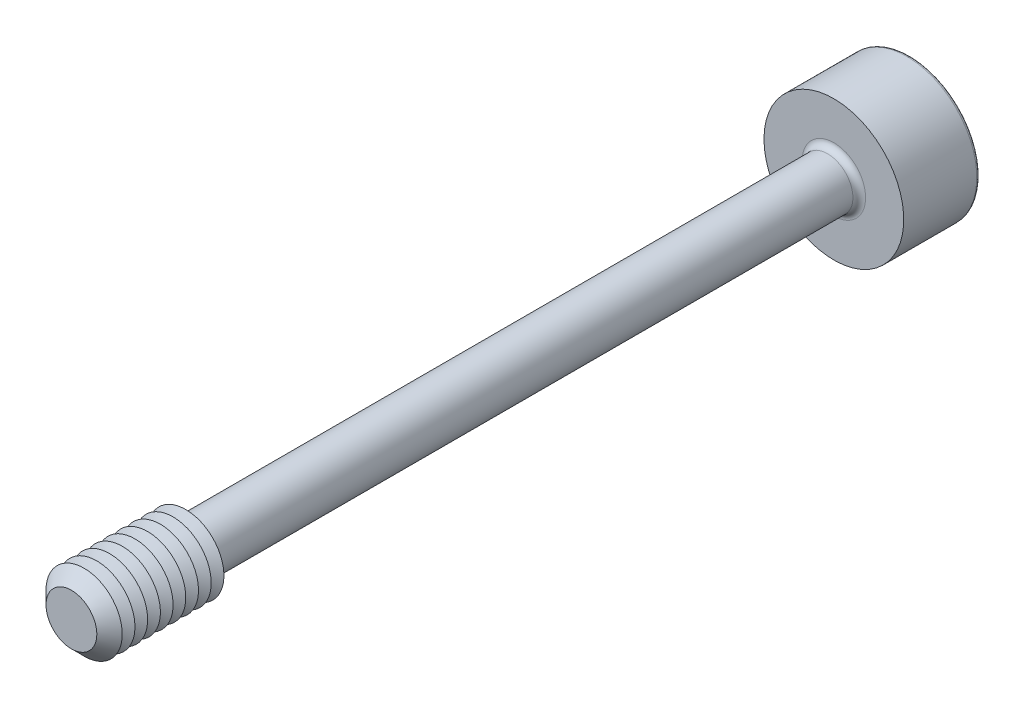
ISO-10303-21;
HEADER;
FILE_DESCRIPTION(('STEP AP214'),'2;1');
FILE_NAME('part.step','',(''),(''),'','','');
FILE_SCHEMA(('AUTOMOTIVE_DESIGN { 1 0 10303 214 1 1 1 1 }'));
ENDSEC;
DATA;
#1=APPLICATION_CONTEXT('core data for automotive mechanical design processes');
#2=APPLICATION_PROTOCOL_DEFINITION('international standard','automotive_design',2000,#1);
#3=PRODUCT_CONTEXT('',#1,'mechanical');
#4=PRODUCT('Part','Part','',(#3));
#5=PRODUCT_RELATED_PRODUCT_CATEGORY('part','',(#4));
#6=PRODUCT_DEFINITION_FORMATION('','',#4);
#7=PRODUCT_DEFINITION_CONTEXT('part definition',#1,'design');
#8=PRODUCT_DEFINITION('design','',#6,#7);
#9=PRODUCT_DEFINITION_SHAPE('','',#8);
#10=(LENGTH_UNIT() NAMED_UNIT(*) SI_UNIT(.MILLI.,.METRE.));
#11=(NAMED_UNIT(*) PLANE_ANGLE_UNIT() SI_UNIT($,.RADIAN.));
#12=(NAMED_UNIT(*) SI_UNIT($,.STERADIAN.) SOLID_ANGLE_UNIT());
#13=UNCERTAINTY_MEASURE_WITH_UNIT(LENGTH_MEASURE(1.E-05),#10,'distance_accuracy_value','');
#14=(GEOMETRIC_REPRESENTATION_CONTEXT(3) GLOBAL_UNCERTAINTY_ASSIGNED_CONTEXT((#13)) GLOBAL_UNIT_ASSIGNED_CONTEXT((#10,
#11,#12)) REPRESENTATION_CONTEXT('',''));
#15=CARTESIAN_POINT('',(0.,0.,0.));
#16=DIRECTION('',(0.,0.,1.));
#17=DIRECTION('',(1.,0.,0.));
#18=AXIS2_PLACEMENT_3D('',#15,#16,#17);
#19=CARTESIAN_POINT('',(-0.721687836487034,-1.25,-15.5));
#20=DIRECTION('',(0.,0.,1.));
#21=DIRECTION('',(1.,0.,0.));
#22=AXIS2_PLACEMENT_3D('',#19,#20,#21);
#23=PLANE('',#22);
#24=DIRECTION('',(1.,0.,0.));
#25=VECTOR('',#24,1.);
#26=CARTESIAN_POINT('',(-0.721687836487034,-1.25,-15.5));
#27=LINE('',#26,#25);
#28=CARTESIAN_POINT('',(0.,-1.25,-15.5));
#29=VERTEX_POINT('',#28);
#30=CARTESIAN_POINT('',(0.721687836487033,-1.25,-15.5));
#31=VERTEX_POINT('',#30);
#32=EDGE_CURVE('E412',#29,#31,#27,.T.);
#33=ORIENTED_EDGE('',*,*,#32,.F.);
#34=CARTESIAN_POINT('',(0.,0.,-15.5));
#35=DIRECTION('',(0.,0.,1.));
#36=DIRECTION('',(0.,-1.,0.));
#37=AXIS2_PLACEMENT_3D('',#34,#35,#36);
#38=CIRCLE('',#37,1.25);
#39=CARTESIAN_POINT('',(1.08253175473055,-0.624999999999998,-15.5));
#40=VERTEX_POINT('',#39);
#41=EDGE_CURVE('E53',#29,#40,#38,.T.);
#42=ORIENTED_EDGE('',*,*,#41,.T.);
#43=DIRECTION('',(0.499999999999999,0.866025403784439,0.));
#44=VECTOR('',#43,1.);
#45=CARTESIAN_POINT('',(0.721687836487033,-1.25,-15.5));
#46=LINE('',#45,#44);
#47=EDGE_CURVE('E401',#31,#40,#46,.T.);
#48=ORIENTED_EDGE('',*,*,#47,.F.);
#49=EDGE_LOOP('',(#33,#42,#48));
#50=FACE_BOUND('',#49,.T.);
#51=ADVANCED_FACE('F41',(#50),#23,.F.);
#52=CARTESIAN_POINT('',(1.44337567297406,0.,-15.5));
#53=VERTEX_POINT('',#52);
#54=EDGE_CURVE('E406',#40,#53,#46,.T.);
#55=ORIENTED_EDGE('',*,*,#54,.F.);
#56=CARTESIAN_POINT('',(1.08253175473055,0.625000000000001,-15.5));
#57=VERTEX_POINT('',#56);
#58=EDGE_CURVE('E11',#40,#57,#38,.T.);
#59=ORIENTED_EDGE('',*,*,#58,.T.);
#60=DIRECTION('',(-0.499999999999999,0.866025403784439,0.));
#61=VECTOR('',#60,1.);
#62=CARTESIAN_POINT('',(1.44337567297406,0.,-15.5));
#63=LINE('',#62,#61);
#64=EDGE_CURVE('E397',#53,#57,#63,.T.);
#65=ORIENTED_EDGE('',*,*,#64,.F.);
#66=EDGE_LOOP('',(#55,#59,#65));
#67=FACE_BOUND('',#66,.T.);
#68=ADVANCED_FACE('F133',(#67),#23,.F.);
#69=CARTESIAN_POINT('',(0.721687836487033,1.25,-15.5));
#70=VERTEX_POINT('',#69);
#71=EDGE_CURVE('E396',#57,#70,#63,.T.);
#72=ORIENTED_EDGE('',*,*,#71,.F.);
#73=CARTESIAN_POINT('',(0.,1.25,-15.5));
#74=VERTEX_POINT('',#73);
#75=EDGE_CURVE('E51',#57,#74,#38,.T.);
#76=ORIENTED_EDGE('',*,*,#75,.T.);
#77=DIRECTION('',(-1.,0.,0.));
#78=VECTOR('',#77,1.);
#79=CARTESIAN_POINT('',(0.721687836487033,1.25,-15.5));
#80=LINE('',#79,#78);
#81=EDGE_CURVE('E177',#70,#74,#80,.T.);
#82=ORIENTED_EDGE('',*,*,#81,.F.);
#83=EDGE_LOOP('',(#72,#76,#82));
#84=FACE_BOUND('',#83,.T.);
#85=ADVANCED_FACE('F139',(#84),#23,.F.);
#86=CARTESIAN_POINT('',(-0.721687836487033,1.25,-15.5));
#87=VERTEX_POINT('',#86);
#88=EDGE_CURVE('E403',#74,#87,#80,.T.);
#89=ORIENTED_EDGE('',*,*,#88,.F.);
#90=CARTESIAN_POINT('',(-1.08253175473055,0.625000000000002,-15.5));
#91=VERTEX_POINT('',#90);
#92=EDGE_CURVE('E266',#74,#91,#38,.T.);
#93=ORIENTED_EDGE('',*,*,#92,.T.);
#94=DIRECTION('',(-0.5,-0.866025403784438,0.));
#95=VECTOR('',#94,1.);
#96=CARTESIAN_POINT('',(-0.721687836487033,1.25,-15.5));
#97=LINE('',#96,#95);
#98=EDGE_CURVE('E176',#87,#91,#97,.T.);
#99=ORIENTED_EDGE('',*,*,#98,.F.);
#100=EDGE_LOOP('',(#89,#93,#99));
#101=FACE_BOUND('',#100,.T.);
#102=ADVANCED_FACE('F157',(#101),#23,.F.);
#103=CARTESIAN_POINT('',(-1.44337567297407,0.,-15.5));
#104=VERTEX_POINT('',#103);
#105=EDGE_CURVE('E170',#91,#104,#97,.T.);
#106=ORIENTED_EDGE('',*,*,#105,.F.);
#107=CARTESIAN_POINT('',(-1.08253175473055,-0.624999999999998,-15.5));
#108=VERTEX_POINT('',#107);
#109=EDGE_CURVE('E172',#91,#108,#38,.T.);
#110=ORIENTED_EDGE('',*,*,#109,.T.);
#111=DIRECTION('',(0.5,-0.866025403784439,0.));
#112=VECTOR('',#111,1.);
#113=CARTESIAN_POINT('',(-1.44337567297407,0.,-15.5));
#114=LINE('',#113,#112);
#115=EDGE_CURVE('E174',#104,#108,#114,.T.);
#116=ORIENTED_EDGE('',*,*,#115,.F.);
#117=EDGE_LOOP('',(#106,#110,#116));
#118=FACE_BOUND('',#117,.T.);
#119=ADVANCED_FACE('F146',(#118),#23,.F.);
#120=CARTESIAN_POINT('',(0.,0.,-18.));
#121=DIRECTION('',(0.,0.,-1.));
#122=DIRECTION('',(-1.,0.,0.));
#123=AXIS2_PLACEMENT_3D('',#120,#121,#122);
#124=PLANE('',#123);
#125=CARTESIAN_POINT('',(0.,0.,-18.));
#126=DIRECTION('',(0.,0.,-1.));
#127=DIRECTION('',(-1.,0.,0.));
#128=AXIS2_PLACEMENT_3D('',#125,#126,#127);
#129=CIRCLE('',#128,2.625);
#130=CARTESIAN_POINT('',(-2.625,0.,-18.));
#131=VERTEX_POINT('',#130);
#132=EDGE_CURVE('E250',#131,#131,#129,.T.);
#133=ORIENTED_EDGE('',*,*,#132,.T.);
#134=EDGE_LOOP('',(#133));
#135=FACE_BOUND('',#134,.T.);
#136=DIRECTION('',(-0.5,-0.866025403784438,0.));
#137=VECTOR('',#136,1.);
#138=CARTESIAN_POINT('',(-0.721687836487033,1.25,-18.));
#139=LINE('',#138,#137);
#140=CARTESIAN_POINT('',(-0.721687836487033,1.25,-18.));
#141=VERTEX_POINT('',#140);
#142=CARTESIAN_POINT('',(-1.44337567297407,0.,-18.));
#143=VERTEX_POINT('',#142);
#144=EDGE_CURVE('E212',#141,#143,#139,.T.);
#145=ORIENTED_EDGE('',*,*,#144,.T.);
#146=DIRECTION('',(0.5,-0.866025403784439,0.));
#147=VECTOR('',#146,1.);
#148=CARTESIAN_POINT('',(-1.44337567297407,0.,-18.));
#149=LINE('',#148,#147);
#150=CARTESIAN_POINT('',(-0.721687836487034,-1.25,-18.));
#151=VERTEX_POINT('',#150);
#152=EDGE_CURVE('E67',#143,#151,#149,.T.);
#153=ORIENTED_EDGE('',*,*,#152,.T.);
#154=DIRECTION('',(1.,0.,0.));
#155=VECTOR('',#154,1.);
#156=CARTESIAN_POINT('',(-0.721687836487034,-1.25,-18.));
#157=LINE('',#156,#155);
#158=CARTESIAN_POINT('',(0.721687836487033,-1.25,-18.));
#159=VERTEX_POINT('',#158);
#160=EDGE_CURVE('E196',#151,#159,#157,.T.);
#161=ORIENTED_EDGE('',*,*,#160,.T.);
#162=DIRECTION('',(0.499999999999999,0.866025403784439,0.));
#163=VECTOR('',#162,1.);
#164=CARTESIAN_POINT('',(0.721687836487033,-1.25,-18.));
#165=LINE('',#164,#163);
#166=CARTESIAN_POINT('',(1.44337567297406,0.,-18.));
#167=VERTEX_POINT('',#166);
#168=EDGE_CURVE('E200',#159,#167,#165,.T.);
#169=ORIENTED_EDGE('',*,*,#168,.T.);
#170=DIRECTION('',(-0.499999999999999,0.866025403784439,0.));
#171=VECTOR('',#170,1.);
#172=CARTESIAN_POINT('',(1.44337567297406,0.,-18.));
#173=LINE('',#172,#171);
#174=CARTESIAN_POINT('',(0.721687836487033,1.25,-18.));
#175=VERTEX_POINT('',#174);
#176=EDGE_CURVE('E204',#167,#175,#173,.T.);
#177=ORIENTED_EDGE('',*,*,#176,.T.);
#178=DIRECTION('',(-1.,0.,0.));
#179=VECTOR('',#178,1.);
#180=CARTESIAN_POINT('',(0.721687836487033,1.25,-18.));
#181=LINE('',#180,#179);
#182=EDGE_CURVE('E208',#175,#141,#181,.T.);
#183=ORIENTED_EDGE('',*,*,#182,.T.);
#184=EDGE_LOOP('',(#145,#153,#161,#169,#177,#183));
#185=FACE_BOUND('',#184,.T.);
#186=ADVANCED_FACE('F156',(#135,#185),#124,.T.);
#187=CARTESIAN_POINT('',(0.,0.,15.));
#188=DIRECTION('',(0.,0.,-1.));
#189=DIRECTION('',(-1.,0.,0.));
#190=AXIS2_PLACEMENT_3D('',#187,#188,#189);
#191=CYLINDRICAL_SURFACE('',#190,1.);
#192=CARTESIAN_POINT('',(0.,0.,-14.75));
#193=DIRECTION('',(0.,0.,-1.));
#194=DIRECTION('',(-1.,0.,0.));
#195=AXIS2_PLACEMENT_3D('',#192,#193,#194);
#196=CIRCLE('',#195,1.);
#197=CARTESIAN_POINT('',(-1.,0.,-14.75));
#198=VERTEX_POINT('',#197);
#199=EDGE_CURVE('E247',#198,#198,#196,.F.);
#200=ORIENTED_EDGE('',*,*,#199,.T.);
#201=EDGE_LOOP('',(#200));
#202=FACE_BOUND('',#201,.T.);
#203=CARTESIAN_POINT('',(0.,0.,10.2113248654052));
#204=DIRECTION('',(0.,0.,-1.));
#205=DIRECTION('',(0.,1.,0.));
#206=AXIS2_PLACEMENT_3D('',#203,#204,#205);
#207=CIRCLE('',#206,1.);
#208=CARTESIAN_POINT('',(0.,1.,10.2113248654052));
#209=VERTEX_POINT('',#208);
#210=EDGE_CURVE('E235',#209,#209,#207,.T.);
#211=ORIENTED_EDGE('',*,*,#210,.T.);
#212=EDGE_LOOP('',(#211));
#213=FACE_BOUND('',#212,.T.);
#214=ADVANCED_FACE('F163',(#202,#213),#191,.T.);
#215=CARTESIAN_POINT('',(0.,0.,10.2113248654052));
#216=DIRECTION('',(0.,0.,1.));
#217=DIRECTION('',(0.,-1.,0.));
#218=AXIS2_PLACEMENT_3D('',#215,#216,#217);
#219=CONICAL_SURFACE('',#218,1.,1.0471975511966);
#220=CARTESIAN_POINT('',(0.,0.,10.5));
#221=DIRECTION('',(0.,0.,-1.));
#222=DIRECTION('',(-1.,0.,0.));
#223=AXIS2_PLACEMENT_3D('',#220,#221,#222);
#224=CIRCLE('',#223,1.5);
#225=CARTESIAN_POINT('',(-1.5,0.,10.5));
#226=VERTEX_POINT('',#225);
#227=EDGE_CURVE('E270',#226,#226,#224,.T.);
#228=ORIENTED_EDGE('',*,*,#227,.T.);
#229=EDGE_LOOP('',(#228));
#230=FACE_BOUND('',#229,.T.);
#231=ORIENTED_EDGE('',*,*,#210,.F.);
#232=EDGE_LOOP('',(#231));
#233=FACE_BOUND('',#232,.T.);
#234=ADVANCED_FACE('F354',(#230,#233),#219,.T.);
#235=CARTESIAN_POINT('',(0.,0.,-15.));
#236=DIRECTION('',(0.,0.,-1.));
#237=DIRECTION('',(-1.,0.,0.));
#238=AXIS2_PLACEMENT_3D('',#235,#236,#237);
#239=PLANE('',#238);
#240=CARTESIAN_POINT('',(0.,0.,-15.));
#241=DIRECTION('',(0.,0.,-1.));
#242=DIRECTION('',(-1.,0.,0.));
#243=AXIS2_PLACEMENT_3D('',#240,#241,#242);
#244=CIRCLE('',#243,1.25);
#245=CARTESIAN_POINT('',(-1.25,0.,-15.));
#246=VERTEX_POINT('',#245);
#247=EDGE_CURVE('E243',#246,#246,#244,.T.);
#248=ORIENTED_EDGE('',*,*,#247,.T.);
#249=EDGE_LOOP('',(#248));
#250=FACE_BOUND('',#249,.T.);
#251=CARTESIAN_POINT('',(0.,0.,-15.));
#252=DIRECTION('',(0.,0.,-1.));
#253=DIRECTION('',(-1.,0.,0.));
#254=AXIS2_PLACEMENT_3D('',#251,#252,#253);
#255=CIRCLE('',#254,2.75);
#256=CARTESIAN_POINT('',(-2.75,0.,-15.));
#257=VERTEX_POINT('',#256);
#258=EDGE_CURVE('E231',#257,#257,#255,.T.);
#259=ORIENTED_EDGE('',*,*,#258,.F.);
#260=EDGE_LOOP('',(#259));
#261=FACE_BOUND('',#260,.T.);
#262=ADVANCED_FACE('F359',(#250,#261),#239,.F.);
#263=CARTESIAN_POINT('',(0.,0.,-18.));
#264=DIRECTION('',(0.,0.,1.));
#265=DIRECTION('',(1.,0.,0.));
#266=AXIS2_PLACEMENT_3D('',#263,#264,#265);
#267=CYLINDRICAL_SURFACE('',#266,2.75);
#268=CARTESIAN_POINT('',(0.,0.,-17.875));
#269=DIRECTION('',(0.,0.,-1.));
#270=DIRECTION('',(-1.,0.,0.));
#271=AXIS2_PLACEMENT_3D('',#268,#269,#270);
#272=CIRCLE('',#271,2.75);
#273=CARTESIAN_POINT('',(-2.75,0.,-17.875));
#274=VERTEX_POINT('',#273);
#275=EDGE_CURVE('E45',#274,#274,#272,.F.);
#276=ORIENTED_EDGE('',*,*,#275,.T.);
#277=EDGE_LOOP('',(#276));
#278=FACE_BOUND('',#277,.T.);
#279=ORIENTED_EDGE('',*,*,#258,.T.);
#280=EDGE_LOOP('',(#279));
#281=FACE_BOUND('',#280,.T.);
#282=ADVANCED_FACE('F360',(#278,#281),#267,.T.);
#283=CARTESIAN_POINT('',(-1.44337567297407,0.,-15.5));
#284=DIRECTION('',(0.866025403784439,0.5,0.));
#285=DIRECTION('',(-0.5,0.866025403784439,0.));
#286=AXIS2_PLACEMENT_3D('',#283,#284,#285);
#287=PLANE('',#286);
#288=ORIENTED_EDGE('',*,*,#152,.F.);
#289=DIRECTION('',(0.,0.,-1.));
#290=VECTOR('',#289,1.);
#291=CARTESIAN_POINT('',(-1.44337567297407,0.,-15.5));
#292=LINE('',#291,#290);
#293=EDGE_CURVE('E186',#104,#143,#292,.T.);
#294=ORIENTED_EDGE('',*,*,#293,.F.);
#295=ORIENTED_EDGE('',*,*,#115,.T.);
#296=CARTESIAN_POINT('',(-0.721687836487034,-1.25,-15.5));
#297=VERTEX_POINT('',#296);
#298=EDGE_CURVE('E215',#108,#297,#114,.T.);
#299=ORIENTED_EDGE('',*,*,#298,.T.);
#300=DIRECTION('',(0.,0.,-1.));
#301=VECTOR('',#300,1.);
#302=CARTESIAN_POINT('',(-0.721687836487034,-1.25,-15.5));
#303=LINE('',#302,#301);
#304=EDGE_CURVE('E228',#297,#151,#303,.T.);
#305=ORIENTED_EDGE('',*,*,#304,.T.);
#306=EDGE_LOOP('',(#288,#294,#295,#299,#305));
#307=FACE_BOUND('',#306,.T.);
#308=ADVANCED_FACE('F363',(#307),#287,.T.);
#309=CARTESIAN_POINT('',(-0.721687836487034,-1.25,-15.5));
#310=DIRECTION('',(0.,1.,0.));
#311=DIRECTION('',(0.,0.,1.));
#312=AXIS2_PLACEMENT_3D('',#309,#310,#311);
#313=PLANE('',#312);
#314=ORIENTED_EDGE('',*,*,#160,.F.);
#315=ORIENTED_EDGE('',*,*,#304,.F.);
#316=EDGE_CURVE('E409',#297,#29,#27,.T.);
#317=ORIENTED_EDGE('',*,*,#316,.T.);
#318=ORIENTED_EDGE('',*,*,#32,.T.);
#319=DIRECTION('',(0.,0.,-1.));
#320=VECTOR('',#319,1.);
#321=CARTESIAN_POINT('',(0.721687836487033,-1.25,-15.5));
#322=LINE('',#321,#320);
#323=EDGE_CURVE('E225',#31,#159,#322,.T.);
#324=ORIENTED_EDGE('',*,*,#323,.T.);
#325=EDGE_LOOP('',(#314,#315,#317,#318,#324));
#326=FACE_BOUND('',#325,.T.);
#327=ADVANCED_FACE('F369',(#326),#313,.T.);
#328=CARTESIAN_POINT('',(0.721687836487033,-1.25,-15.5));
#329=DIRECTION('',(-0.866025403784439,0.499999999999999,0.));
#330=DIRECTION('',(-0.499999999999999,-0.866025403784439,0.));
#331=AXIS2_PLACEMENT_3D('',#328,#329,#330);
#332=PLANE('',#331);
#333=ORIENTED_EDGE('',*,*,#168,.F.);
#334=ORIENTED_EDGE('',*,*,#323,.F.);
#335=ORIENTED_EDGE('',*,*,#47,.T.);
#336=ORIENTED_EDGE('',*,*,#54,.T.);
#337=DIRECTION('',(0.,0.,-1.));
#338=VECTOR('',#337,1.);
#339=CARTESIAN_POINT('',(1.44337567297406,0.,-15.5));
#340=LINE('',#339,#338);
#341=EDGE_CURVE('E222',#53,#167,#340,.T.);
#342=ORIENTED_EDGE('',*,*,#341,.T.);
#343=EDGE_LOOP('',(#333,#334,#335,#336,#342));
#344=FACE_BOUND('',#343,.T.);
#345=ADVANCED_FACE('F372',(#344),#332,.T.);
#346=CARTESIAN_POINT('',(1.44337567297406,0.,-15.5));
#347=DIRECTION('',(-0.866025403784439,-0.5,0.));
#348=DIRECTION('',(0.5,-0.866025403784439,0.));
#349=AXIS2_PLACEMENT_3D('',#346,#347,#348);
#350=PLANE('',#349);
#351=ORIENTED_EDGE('',*,*,#176,.F.);
#352=ORIENTED_EDGE('',*,*,#341,.F.);
#353=ORIENTED_EDGE('',*,*,#64,.T.);
#354=ORIENTED_EDGE('',*,*,#71,.T.);
#355=DIRECTION('',(0.,0.,-1.));
#356=VECTOR('',#355,1.);
#357=CARTESIAN_POINT('',(0.721687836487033,1.25,-15.5));
#358=LINE('',#357,#356);
#359=EDGE_CURVE('E219',#70,#175,#358,.T.);
#360=ORIENTED_EDGE('',*,*,#359,.T.);
#361=EDGE_LOOP('',(#351,#352,#353,#354,#360));
#362=FACE_BOUND('',#361,.T.);
#363=ADVANCED_FACE('F376',(#362),#350,.T.);
#364=CARTESIAN_POINT('',(0.721687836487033,1.25,-15.5));
#365=DIRECTION('',(0.,-1.,0.));
#366=DIRECTION('',(1.,0.,0.));
#367=AXIS2_PLACEMENT_3D('',#364,#365,#366);
#368=PLANE('',#367);
#369=ORIENTED_EDGE('',*,*,#182,.F.);
#370=ORIENTED_EDGE('',*,*,#359,.F.);
#371=ORIENTED_EDGE('',*,*,#81,.T.);
#372=ORIENTED_EDGE('',*,*,#88,.T.);
#373=DIRECTION('',(0.,0.,-1.));
#374=VECTOR('',#373,1.);
#375=CARTESIAN_POINT('',(-0.721687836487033,1.25,-15.5));
#376=LINE('',#375,#374);
#377=EDGE_CURVE('E182',#87,#141,#376,.T.);
#378=ORIENTED_EDGE('',*,*,#377,.T.);
#379=EDGE_LOOP('',(#369,#370,#371,#372,#378));
#380=FACE_BOUND('',#379,.T.);
#381=ADVANCED_FACE('F152',(#380),#368,.T.);
#382=CARTESIAN_POINT('',(-0.721687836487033,1.25,-15.5));
#383=DIRECTION('',(0.866025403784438,-0.5,0.));
#384=DIRECTION('',(0.5,0.866025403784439,0.));
#385=AXIS2_PLACEMENT_3D('',#382,#383,#384);
#386=PLANE('',#385);
#387=ORIENTED_EDGE('',*,*,#144,.F.);
#388=ORIENTED_EDGE('',*,*,#377,.F.);
#389=ORIENTED_EDGE('',*,*,#98,.T.);
#390=ORIENTED_EDGE('',*,*,#105,.T.);
#391=ORIENTED_EDGE('',*,*,#293,.T.);
#392=EDGE_LOOP('',(#387,#388,#389,#390,#391));
#393=FACE_BOUND('',#392,.T.);
#394=ADVANCED_FACE('F144',(#393),#386,.T.);
#395=ORIENTED_EDGE('',*,*,#298,.F.);
#396=EDGE_CURVE('E257',#108,#29,#38,.T.);
#397=ORIENTED_EDGE('',*,*,#396,.T.);
#398=ORIENTED_EDGE('',*,*,#316,.F.);
#399=EDGE_LOOP('',(#395,#397,#398));
#400=FACE_BOUND('',#399,.T.);
#401=ADVANCED_FACE('F135',(#400),#23,.F.);
#402=CARTESIAN_POINT('',(0.,0.,-14.75));
#403=DIRECTION('',(0.,0.,-1.));
#404=DIRECTION('',(-1.,0.,0.));
#405=AXIS2_PLACEMENT_3D('',#402,#403,#404);
#406=TOROIDAL_SURFACE('',#405,1.25,0.25);
#407=ORIENTED_EDGE('',*,*,#199,.F.);
#408=EDGE_LOOP('',(#407));
#409=FACE_BOUND('',#408,.T.);
#410=ORIENTED_EDGE('',*,*,#247,.F.);
#411=EDGE_LOOP('',(#410));
#412=FACE_BOUND('',#411,.T.);
#413=ADVANCED_FACE('F129',(#409,#412),#406,.F.);
#414=CARTESIAN_POINT('',(0.,0.,-17.875));
#415=DIRECTION('',(0.,0.,-1.));
#416=DIRECTION('',(-1.,0.,0.));
#417=AXIS2_PLACEMENT_3D('',#414,#415,#416);
#418=TOROIDAL_SURFACE('',#417,2.625,0.125);
#419=ORIENTED_EDGE('',*,*,#275,.F.);
#420=EDGE_LOOP('',(#419));
#421=FACE_BOUND('',#420,.T.);
#422=ORIENTED_EDGE('',*,*,#132,.F.);
#423=EDGE_LOOP('',(#422));
#424=FACE_BOUND('',#423,.T.);
#425=ADVANCED_FACE('F43',(#421,#424),#418,.T.);
#426=CARTESIAN_POINT('',(0.,0.,-14.778312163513));
#427=DIRECTION('',(0.,0.,-1.));
#428=DIRECTION('',(0.,1.,0.));
#429=AXIS2_PLACEMENT_3D('',#426,#427,#428);
#430=CONICAL_SURFACE('',#429,0.,1.0471975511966);
#431=ORIENTED_EDGE('',*,*,#41,.F.);
#432=ORIENTED_EDGE('',*,*,#396,.F.);
#433=ORIENTED_EDGE('',*,*,#109,.F.);
#434=ORIENTED_EDGE('',*,*,#92,.F.);
#435=ORIENTED_EDGE('',*,*,#75,.F.);
#436=ORIENTED_EDGE('',*,*,#58,.F.);
#437=EDGE_LOOP('',(#431,#432,#433,#434,#435,#436));
#438=FACE_BOUND('',#437,.T.);
#439=CARTESIAN_POINT('',(0.,0.,-14.778312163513));
#440=VERTEX_POINT('',#439);
#441=VERTEX_LOOP('',#440);
#442=FACE_BOUND('',#441,.T.);
#443=ADVANCED_FACE('F118',(#438,#442),#430,.F.);
#444=CARTESIAN_POINT('',(0.,0.,10.75));
#445=DIRECTION('',(0.,0.,-1.));
#446=DIRECTION('',(-1.,0.,0.));
#447=AXIS2_PLACEMENT_3D('',#444,#445,#446);
#448=CONICAL_SURFACE('',#447,1.06698729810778,1.0471975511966);
#449=ORIENTED_EDGE('',*,*,#227,.F.);
#450=EDGE_LOOP('',(#449));
#451=FACE_BOUND('',#450,.T.);
#452=CARTESIAN_POINT('',(0.,0.,10.75));
#453=DIRECTION('',(0.,0.,-1.));
#454=DIRECTION('',(-1.,0.,0.));
#455=AXIS2_PLACEMENT_3D('',#452,#453,#454);
#456=CIRCLE('',#455,1.06698729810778);
#457=CARTESIAN_POINT('',(-1.06698729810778,0.,10.75));
#458=VERTEX_POINT('',#457);
#459=EDGE_CURVE('E275',#458,#458,#456,.T.);
#460=ORIENTED_EDGE('',*,*,#459,.T.);
#461=EDGE_LOOP('',(#460));
#462=FACE_BOUND('',#461,.T.);
#463=ADVANCED_FACE('F120',(#451,#462),#448,.T.);
#464=CARTESIAN_POINT('',(0.,0.,11.));
#465=DIRECTION('',(0.,0.,1.));
#466=DIRECTION('',(1.,0.,0.));
#467=AXIS2_PLACEMENT_3D('',#464,#465,#466);
#468=CONICAL_SURFACE('',#467,1.5,1.0471975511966);
#469=ORIENTED_EDGE('',*,*,#459,.F.);
#470=EDGE_LOOP('',(#469));
#471=FACE_BOUND('',#470,.T.);
#472=CARTESIAN_POINT('',(0.,0.,11.));
#473=DIRECTION('',(0.,0.,-1.));
#474=DIRECTION('',(-1.,0.,0.));
#475=AXIS2_PLACEMENT_3D('',#472,#473,#474);
#476=CIRCLE('',#475,1.5);
#477=CARTESIAN_POINT('',(-1.5,0.,11.));
#478=VERTEX_POINT('',#477);
#479=EDGE_CURVE('E281',#478,#478,#476,.T.);
#480=ORIENTED_EDGE('',*,*,#479,.T.);
#481=EDGE_LOOP('',(#480));
#482=FACE_BOUND('',#481,.T.);
#483=ADVANCED_FACE('F126',(#471,#482),#468,.T.);
#484=CARTESIAN_POINT('',(0.,0.,11.25));
#485=DIRECTION('',(0.,0.,-1.));
#486=DIRECTION('',(-1.,0.,0.));
#487=AXIS2_PLACEMENT_3D('',#484,#485,#486);
#488=CONICAL_SURFACE('',#487,1.06698729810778,1.0471975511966);
#489=ORIENTED_EDGE('',*,*,#479,.F.);
#490=EDGE_LOOP('',(#489));
#491=FACE_BOUND('',#490,.T.);
#492=CARTESIAN_POINT('',(0.,0.,11.25));
#493=DIRECTION('',(0.,0.,-1.));
#494=DIRECTION('',(-1.,0.,0.));
#495=AXIS2_PLACEMENT_3D('',#492,#493,#494);
#496=CIRCLE('',#495,1.06698729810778);
#497=CARTESIAN_POINT('',(-1.06698729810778,0.,11.25));
#498=VERTEX_POINT('',#497);
#499=EDGE_CURVE('E286',#498,#498,#496,.T.);
#500=ORIENTED_EDGE('',*,*,#499,.T.);
#501=EDGE_LOOP('',(#500));
#502=FACE_BOUND('',#501,.T.);
#503=ADVANCED_FACE('F516',(#491,#502),#488,.T.);
#504=CARTESIAN_POINT('',(0.,0.,11.5));
#505=DIRECTION('',(0.,0.,1.));
#506=DIRECTION('',(1.,0.,0.));
#507=AXIS2_PLACEMENT_3D('',#504,#505,#506);
#508=CONICAL_SURFACE('',#507,1.5,1.0471975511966);
#509=ORIENTED_EDGE('',*,*,#499,.F.);
#510=EDGE_LOOP('',(#509));
#511=FACE_BOUND('',#510,.T.);
#512=CARTESIAN_POINT('',(0.,0.,11.5));
#513=DIRECTION('',(0.,0.,-1.));
#514=DIRECTION('',(-1.,0.,0.));
#515=AXIS2_PLACEMENT_3D('',#512,#513,#514);
#516=CIRCLE('',#515,1.5);
#517=CARTESIAN_POINT('',(-1.5,0.,11.5));
#518=VERTEX_POINT('',#517);
#519=EDGE_CURVE('E289',#518,#518,#516,.T.);
#520=ORIENTED_EDGE('',*,*,#519,.T.);
#521=EDGE_LOOP('',(#520));
#522=FACE_BOUND('',#521,.T.);
#523=ADVANCED_FACE('F525',(#511,#522),#508,.T.);
#524=CARTESIAN_POINT('',(0.,0.,11.75));
#525=DIRECTION('',(0.,0.,-1.));
#526=DIRECTION('',(-1.,0.,0.));
#527=AXIS2_PLACEMENT_3D('',#524,#525,#526);
#528=CONICAL_SURFACE('',#527,1.06698729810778,1.0471975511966);
#529=ORIENTED_EDGE('',*,*,#519,.F.);
#530=EDGE_LOOP('',(#529));
#531=FACE_BOUND('',#530,.T.);
#532=CARTESIAN_POINT('',(0.,0.,11.75));
#533=DIRECTION('',(0.,0.,-1.));
#534=DIRECTION('',(-1.,0.,0.));
#535=AXIS2_PLACEMENT_3D('',#532,#533,#534);
#536=CIRCLE('',#535,1.06698729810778);
#537=CARTESIAN_POINT('',(-1.06698729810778,0.,11.75));
#538=VERTEX_POINT('',#537);
#539=EDGE_CURVE('E293',#538,#538,#536,.T.);
#540=ORIENTED_EDGE('',*,*,#539,.T.);
#541=EDGE_LOOP('',(#540));
#542=FACE_BOUND('',#541,.T.);
#543=ADVANCED_FACE('F534',(#531,#542),#528,.T.);
#544=CARTESIAN_POINT('',(0.,0.,12.));
#545=DIRECTION('',(0.,0.,1.));
#546=DIRECTION('',(1.,0.,0.));
#547=AXIS2_PLACEMENT_3D('',#544,#545,#546);
#548=CONICAL_SURFACE('',#547,1.5,1.0471975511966);
#549=ORIENTED_EDGE('',*,*,#539,.F.);
#550=EDGE_LOOP('',(#549));
#551=FACE_BOUND('',#550,.T.);
#552=CARTESIAN_POINT('',(0.,0.,12.));
#553=DIRECTION('',(0.,0.,-1.));
#554=DIRECTION('',(-1.,0.,0.));
#555=AXIS2_PLACEMENT_3D('',#552,#553,#554);
#556=CIRCLE('',#555,1.5);
#557=CARTESIAN_POINT('',(-1.5,0.,12.));
#558=VERTEX_POINT('',#557);
#559=EDGE_CURVE('E297',#558,#558,#556,.T.);
#560=ORIENTED_EDGE('',*,*,#559,.T.);
#561=EDGE_LOOP('',(#560));
#562=FACE_BOUND('',#561,.T.);
#563=ADVANCED_FACE('F543',(#551,#562),#548,.T.);
#564=CARTESIAN_POINT('',(0.,0.,12.25));
#565=DIRECTION('',(0.,0.,-1.));
#566=DIRECTION('',(-1.,0.,0.));
#567=AXIS2_PLACEMENT_3D('',#564,#565,#566);
#568=CONICAL_SURFACE('',#567,1.06698729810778,1.0471975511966);
#569=ORIENTED_EDGE('',*,*,#559,.F.);
#570=EDGE_LOOP('',(#569));
#571=FACE_BOUND('',#570,.T.);
#572=CARTESIAN_POINT('',(0.,0.,12.25));
#573=DIRECTION('',(0.,0.,-1.));
#574=DIRECTION('',(-1.,0.,0.));
#575=AXIS2_PLACEMENT_3D('',#572,#573,#574);
#576=CIRCLE('',#575,1.06698729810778);
#577=CARTESIAN_POINT('',(-1.06698729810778,0.,12.25));
#578=VERTEX_POINT('',#577);
#579=EDGE_CURVE('E301',#578,#578,#576,.T.);
#580=ORIENTED_EDGE('',*,*,#579,.T.);
#581=EDGE_LOOP('',(#580));
#582=FACE_BOUND('',#581,.T.);
#583=ADVANCED_FACE('F552',(#571,#582),#568,.T.);
#584=CARTESIAN_POINT('',(0.,0.,12.5));
#585=DIRECTION('',(0.,0.,1.));
#586=DIRECTION('',(1.,0.,0.));
#587=AXIS2_PLACEMENT_3D('',#584,#585,#586);
#588=CONICAL_SURFACE('',#587,1.5,1.0471975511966);
#589=ORIENTED_EDGE('',*,*,#579,.F.);
#590=EDGE_LOOP('',(#589));
#591=FACE_BOUND('',#590,.T.);
#592=CARTESIAN_POINT('',(0.,0.,12.5));
#593=DIRECTION('',(0.,0.,-1.));
#594=DIRECTION('',(-1.,0.,0.));
#595=AXIS2_PLACEMENT_3D('',#592,#593,#594);
#596=CIRCLE('',#595,1.5);
#597=CARTESIAN_POINT('',(-1.5,0.,12.5));
#598=VERTEX_POINT('',#597);
#599=EDGE_CURVE('E304',#598,#598,#596,.T.);
#600=ORIENTED_EDGE('',*,*,#599,.T.);
#601=EDGE_LOOP('',(#600));
#602=FACE_BOUND('',#601,.T.);
#603=ADVANCED_FACE('F561',(#591,#602),#588,.T.);
#604=CARTESIAN_POINT('',(0.,0.,12.75));
#605=DIRECTION('',(0.,0.,-1.));
#606=DIRECTION('',(-1.,0.,0.));
#607=AXIS2_PLACEMENT_3D('',#604,#605,#606);
#608=CONICAL_SURFACE('',#607,1.06698729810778,1.0471975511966);
#609=ORIENTED_EDGE('',*,*,#599,.F.);
#610=EDGE_LOOP('',(#609));
#611=FACE_BOUND('',#610,.T.);
#612=CARTESIAN_POINT('',(0.,0.,12.75));
#613=DIRECTION('',(0.,0.,-1.));
#614=DIRECTION('',(-1.,0.,0.));
#615=AXIS2_PLACEMENT_3D('',#612,#613,#614);
#616=CIRCLE('',#615,1.06698729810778);
#617=CARTESIAN_POINT('',(-1.06698729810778,0.,12.75));
#618=VERTEX_POINT('',#617);
#619=EDGE_CURVE('E307',#618,#618,#616,.T.);
#620=ORIENTED_EDGE('',*,*,#619,.T.);
#621=EDGE_LOOP('',(#620));
#622=FACE_BOUND('',#621,.T.);
#623=ADVANCED_FACE('F570',(#611,#622),#608,.T.);
#624=CARTESIAN_POINT('',(0.,0.,13.));
#625=DIRECTION('',(0.,0.,1.));
#626=DIRECTION('',(1.,0.,0.));
#627=AXIS2_PLACEMENT_3D('',#624,#625,#626);
#628=CONICAL_SURFACE('',#627,1.5,1.0471975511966);
#629=ORIENTED_EDGE('',*,*,#619,.F.);
#630=EDGE_LOOP('',(#629));
#631=FACE_BOUND('',#630,.T.);
#632=CARTESIAN_POINT('',(0.,0.,13.));
#633=DIRECTION('',(0.,0.,-1.));
#634=DIRECTION('',(-1.,0.,0.));
#635=AXIS2_PLACEMENT_3D('',#632,#633,#634);
#636=CIRCLE('',#635,1.5);
#637=CARTESIAN_POINT('',(-1.5,0.,13.));
#638=VERTEX_POINT('',#637);
#639=EDGE_CURVE('E311',#638,#638,#636,.T.);
#640=ORIENTED_EDGE('',*,*,#639,.T.);
#641=EDGE_LOOP('',(#640));
#642=FACE_BOUND('',#641,.T.);
#643=ADVANCED_FACE('F579',(#631,#642),#628,.T.);
#644=CARTESIAN_POINT('',(0.,0.,13.25));
#645=DIRECTION('',(0.,0.,-1.));
#646=DIRECTION('',(-1.,0.,0.));
#647=AXIS2_PLACEMENT_3D('',#644,#645,#646);
#648=CONICAL_SURFACE('',#647,1.06698729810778,1.0471975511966);
#649=ORIENTED_EDGE('',*,*,#639,.F.);
#650=EDGE_LOOP('',(#649));
#651=FACE_BOUND('',#650,.T.);
#652=CARTESIAN_POINT('',(0.,0.,13.25));
#653=DIRECTION('',(0.,0.,-1.));
#654=DIRECTION('',(-1.,0.,0.));
#655=AXIS2_PLACEMENT_3D('',#652,#653,#654);
#656=CIRCLE('',#655,1.06698729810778);
#657=CARTESIAN_POINT('',(-1.06698729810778,0.,13.25));
#658=VERTEX_POINT('',#657);
#659=EDGE_CURVE('E315',#658,#658,#656,.T.);
#660=ORIENTED_EDGE('',*,*,#659,.T.);
#661=EDGE_LOOP('',(#660));
#662=FACE_BOUND('',#661,.T.);
#663=ADVANCED_FACE('F588',(#651,#662),#648,.T.);
#664=CARTESIAN_POINT('',(0.,0.,13.5));
#665=DIRECTION('',(0.,0.,1.));
#666=DIRECTION('',(1.,0.,0.));
#667=AXIS2_PLACEMENT_3D('',#664,#665,#666);
#668=CONICAL_SURFACE('',#667,1.5,1.0471975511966);
#669=ORIENTED_EDGE('',*,*,#659,.F.);
#670=EDGE_LOOP('',(#669));
#671=FACE_BOUND('',#670,.T.);
#672=CARTESIAN_POINT('',(0.,0.,13.5));
#673=DIRECTION('',(0.,0.,-1.));
#674=DIRECTION('',(-1.,0.,0.));
#675=AXIS2_PLACEMENT_3D('',#672,#673,#674);
#676=CIRCLE('',#675,1.5);
#677=CARTESIAN_POINT('',(-1.5,0.,13.5));
#678=VERTEX_POINT('',#677);
#679=EDGE_CURVE('E318',#678,#678,#676,.T.);
#680=ORIENTED_EDGE('',*,*,#679,.T.);
#681=EDGE_LOOP('',(#680));
#682=FACE_BOUND('',#681,.T.);
#683=ADVANCED_FACE('F597',(#671,#682),#668,.T.);
#684=CARTESIAN_POINT('',(0.,0.,13.75));
#685=DIRECTION('',(0.,0.,-1.));
#686=DIRECTION('',(-1.,0.,0.));
#687=AXIS2_PLACEMENT_3D('',#684,#685,#686);
#688=CONICAL_SURFACE('',#687,1.06698729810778,1.0471975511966);
#689=ORIENTED_EDGE('',*,*,#679,.F.);
#690=EDGE_LOOP('',(#689));
#691=FACE_BOUND('',#690,.T.);
#692=CARTESIAN_POINT('',(0.,0.,13.75));
#693=DIRECTION('',(0.,0.,-1.));
#694=DIRECTION('',(-1.,0.,0.));
#695=AXIS2_PLACEMENT_3D('',#692,#693,#694);
#696=CIRCLE('',#695,1.06698729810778);
#697=CARTESIAN_POINT('',(-1.06698729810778,0.,13.75));
#698=VERTEX_POINT('',#697);
#699=EDGE_CURVE('E321',#698,#698,#696,.T.);
#700=ORIENTED_EDGE('',*,*,#699,.T.);
#701=EDGE_LOOP('',(#700));
#702=FACE_BOUND('',#701,.T.);
#703=ADVANCED_FACE('F606',(#691,#702),#688,.T.);
#704=CARTESIAN_POINT('',(0.,0.,14.));
#705=DIRECTION('',(0.,0.,1.));
#706=DIRECTION('',(1.,0.,0.));
#707=AXIS2_PLACEMENT_3D('',#704,#705,#706);
#708=CONICAL_SURFACE('',#707,1.5,1.0471975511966);
#709=ORIENTED_EDGE('',*,*,#699,.F.);
#710=EDGE_LOOP('',(#709));
#711=FACE_BOUND('',#710,.T.);
#712=CARTESIAN_POINT('',(0.,0.,14.));
#713=DIRECTION('',(0.,0.,-1.));
#714=DIRECTION('',(-1.,0.,0.));
#715=AXIS2_PLACEMENT_3D('',#712,#713,#714);
#716=CIRCLE('',#715,1.5);
#717=CARTESIAN_POINT('',(-1.5,0.,14.));
#718=VERTEX_POINT('',#717);
#719=EDGE_CURVE('E325',#718,#718,#716,.T.);
#720=ORIENTED_EDGE('',*,*,#719,.T.);
#721=EDGE_LOOP('',(#720));
#722=FACE_BOUND('',#721,.T.);
#723=ADVANCED_FACE('F615',(#711,#722),#708,.T.);
#724=CARTESIAN_POINT('',(0.,0.,14.25));
#725=DIRECTION('',(0.,0.,-1.));
#726=DIRECTION('',(-1.,0.,0.));
#727=AXIS2_PLACEMENT_3D('',#724,#725,#726);
#728=CONICAL_SURFACE('',#727,1.06698729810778,1.0471975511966);
#729=ORIENTED_EDGE('',*,*,#719,.F.);
#730=EDGE_LOOP('',(#729));
#731=FACE_BOUND('',#730,.T.);
#732=CARTESIAN_POINT('',(0.,0.,14.25));
#733=DIRECTION('',(0.,0.,-1.));
#734=DIRECTION('',(-1.,0.,0.));
#735=AXIS2_PLACEMENT_3D('',#732,#733,#734);
#736=CIRCLE('',#735,1.06698729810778);
#737=CARTESIAN_POINT('',(-1.06698729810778,0.,14.25));
#738=VERTEX_POINT('',#737);
#739=EDGE_CURVE('E329',#738,#738,#736,.T.);
#740=ORIENTED_EDGE('',*,*,#739,.T.);
#741=EDGE_LOOP('',(#740));
#742=FACE_BOUND('',#741,.T.);
#743=ADVANCED_FACE('F624',(#731,#742),#728,.T.);
#744=CARTESIAN_POINT('',(0.,0.,14.5));
#745=DIRECTION('',(0.,0.,1.));
#746=DIRECTION('',(1.,0.,0.));
#747=AXIS2_PLACEMENT_3D('',#744,#745,#746);
#748=CONICAL_SURFACE('',#747,1.5,1.0471975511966);
#749=ORIENTED_EDGE('',*,*,#739,.F.);
#750=EDGE_LOOP('',(#749));
#751=FACE_BOUND('',#750,.T.);
#752=CARTESIAN_POINT('',(0.,0.,14.5));
#753=DIRECTION('',(0.,0.,-1.));
#754=DIRECTION('',(-1.,0.,0.));
#755=AXIS2_PLACEMENT_3D('',#752,#753,#754);
#756=CIRCLE('',#755,1.5);
#757=CARTESIAN_POINT('',(-1.5,0.,14.5));
#758=VERTEX_POINT('',#757);
#759=EDGE_CURVE('E333',#758,#758,#756,.T.);
#760=ORIENTED_EDGE('',*,*,#759,.T.);
#761=EDGE_LOOP('',(#760));
#762=FACE_BOUND('',#761,.T.);
#763=ADVANCED_FACE('F339',(#751,#762),#748,.T.);
#764=CARTESIAN_POINT('',(0.,0.,15.));
#765=DIRECTION('',(0.,0.,1.));
#766=DIRECTION('',(1.,0.,0.));
#767=AXIS2_PLACEMENT_3D('',#764,#765,#766);
#768=PLANE('',#767);
#769=CARTESIAN_POINT('',(0.,0.,15.));
#770=DIRECTION('',(0.,0.,1.));
#771=DIRECTION('',(1.,0.,0.));
#772=AXIS2_PLACEMENT_3D('',#769,#770,#771);
#773=CIRCLE('',#772,0.999999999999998);
#774=CARTESIAN_POINT('',(0.999999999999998,0.,15.));
#775=VERTEX_POINT('',#774);
#776=EDGE_CURVE('E239',#775,#775,#773,.T.);
#777=ORIENTED_EDGE('',*,*,#776,.T.);
#778=EDGE_LOOP('',(#777));
#779=FACE_BOUND('',#778,.T.);
#780=ADVANCED_FACE('F343',(#779),#768,.T.);
#781=CARTESIAN_POINT('',(0.,0.,14.5));
#782=DIRECTION('',(0.,0.,-1.));
#783=DIRECTION('',(0.,1.,0.));
#784=AXIS2_PLACEMENT_3D('',#781,#782,#783);
#785=CONICAL_SURFACE('',#784,1.5,0.78539816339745);
#786=ORIENTED_EDGE('',*,*,#776,.F.);
#787=EDGE_LOOP('',(#786));
#788=FACE_BOUND('',#787,.T.);
#789=ORIENTED_EDGE('',*,*,#759,.F.);
#790=EDGE_LOOP('',(#789));
#791=FACE_BOUND('',#790,.T.);
#792=ADVANCED_FACE('F341',(#788,#791),#785,.T.);
#793=CLOSED_SHELL('',(#51,#68,#85,#102,#119,#186,#214,#234,#262,#282,#308,#327,#345,#363,#381,
#394,#401,#413,#425,#443,#463,#483,#503,#523,#543,#563,#583,#603,#623,#643,#663,#683,#703,#723,
#743,#763,#780,#792));
#794=MANIFOLD_SOLID_BREP('B2',#793);
#795=ADVANCED_BREP_SHAPE_REPRESENTATION('',(#18,#794),#14);
#796=SHAPE_DEFINITION_REPRESENTATION(#9,#795);
ENDSEC;
END-ISO-10303-21;
